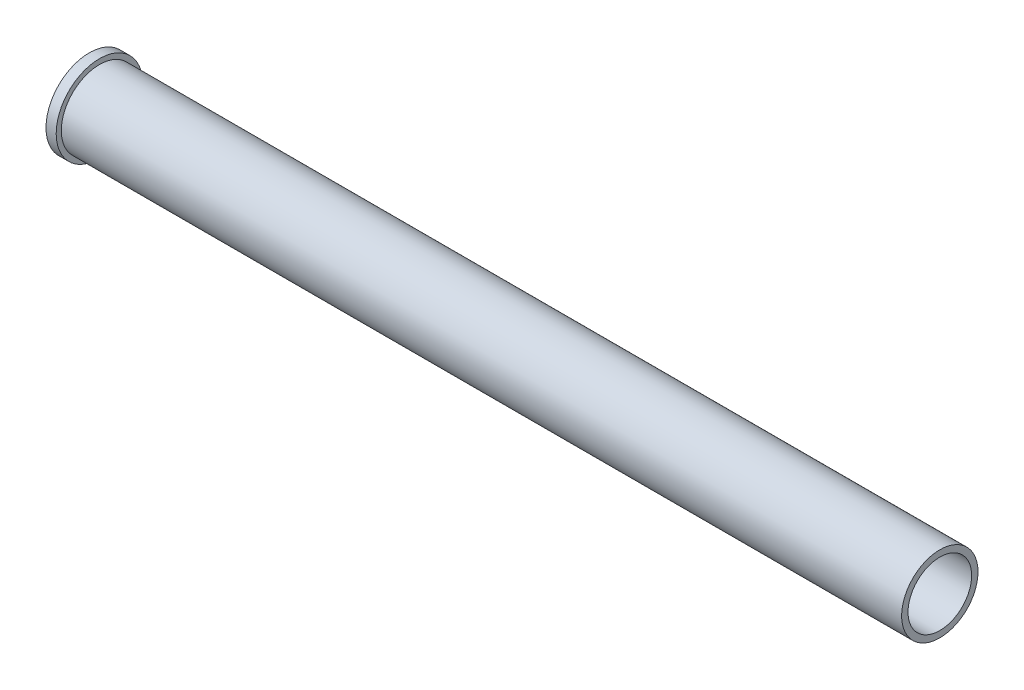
from build123d import *

# Parameters (mm, degrees)
SKETCH1_R           = 7.5
SKETCH1_R_2         = 5
BOSS_EXTRUDE1_DEPTH = 165.1
SKETCH2_R           = 6.25
CUT_EXTRUDE1_DEPTH  = 25.4
BOSS_EXTRUDE2_START = 2
SKETCH3_R           = 8.5
SKETCH3_R_2         = 5
BOSS_EXTRUDE2_DEPTH = 2


with BuildPart() as part:
    # Sketch1 → Boss-Extrude1 (new body)
    with BuildSketch(Plane(origin=(0, 0, 0), x_dir=(0, 0, -1), z_dir=(1, 0, 0))):
        Circle(SKETCH1_R)
        Circle(SKETCH1_R_2, mode=Mode.SUBTRACT)
    extrude(amount=BOSS_EXTRUDE1_DEPTH)

    # Sketch2 → Cut-Extrude1 (cut)
    with BuildSketch(Plane(origin=(165.1, 0, 0), x_dir=(0, 0, -1), z_dir=(1, 0, 0))):
        Circle(SKETCH2_R)
    extrude(amount=-CUT_EXTRUDE1_DEPTH, mode=Mode.SUBTRACT)

    # Sketch3 → Boss-Extrude2 (add)
    with BuildSketch(Plane.ZY.offset(BOSS_EXTRUDE2_START)):
        Circle(SKETCH3_R)
        Circle(SKETCH3_R_2, mode=Mode.SUBTRACT)
    extrude(amount=-BOSS_EXTRUDE2_DEPTH)


solid = part.part
